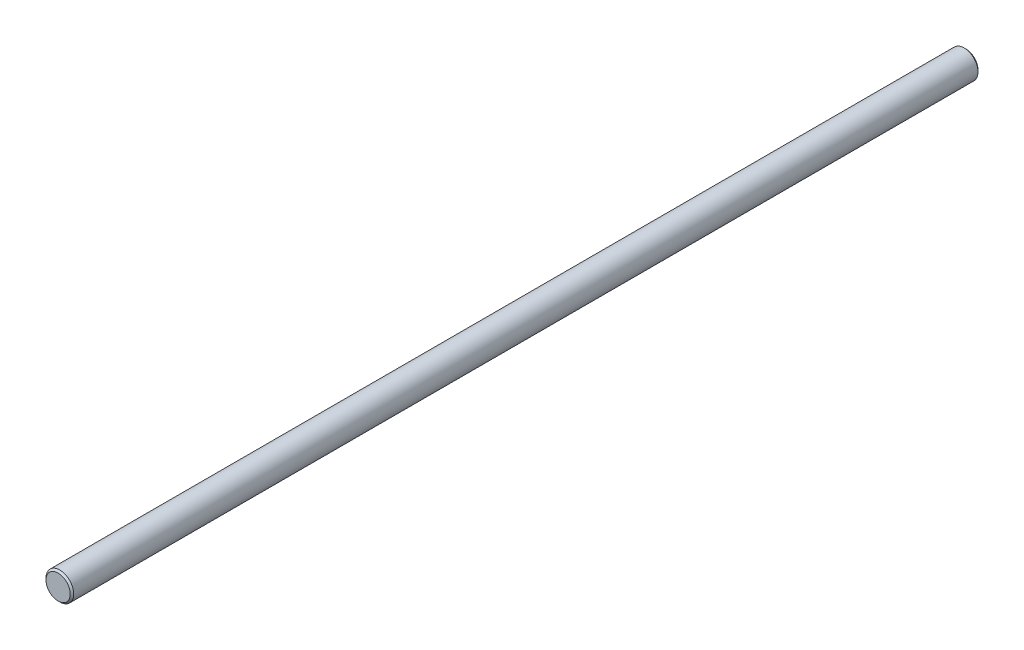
from build123d import *

# Parameters (mm, degrees)
SKETCH_1_R      = 4
EXTRUDE_1_DEPTH = 262
CHAMFER_1_SIZE  = 0.5


with BuildPart() as part:
    # Sketch 1 → Extrude 1 (new body)
    with BuildSketch(Plane(origin=(0, 0, -267), x_dir=(-1, 0, 0), z_dir=(0, 0, -1))):
        with Locations(Location((0, 0, 0), (0, 0, 180))):
            Circle(SKETCH_1_R)
    extrude(amount=-EXTRUDE_1_DEPTH)

    # Chamfer 1
    chamfer_1_edges = [part.edges().sort_by_distance(p)[0] for p in [
        (-4, 0, -267),
        (-4, 0, -5),
    ]]
    chamfer(chamfer_1_edges, length=CHAMFER_1_SIZE)


solid = part.part
